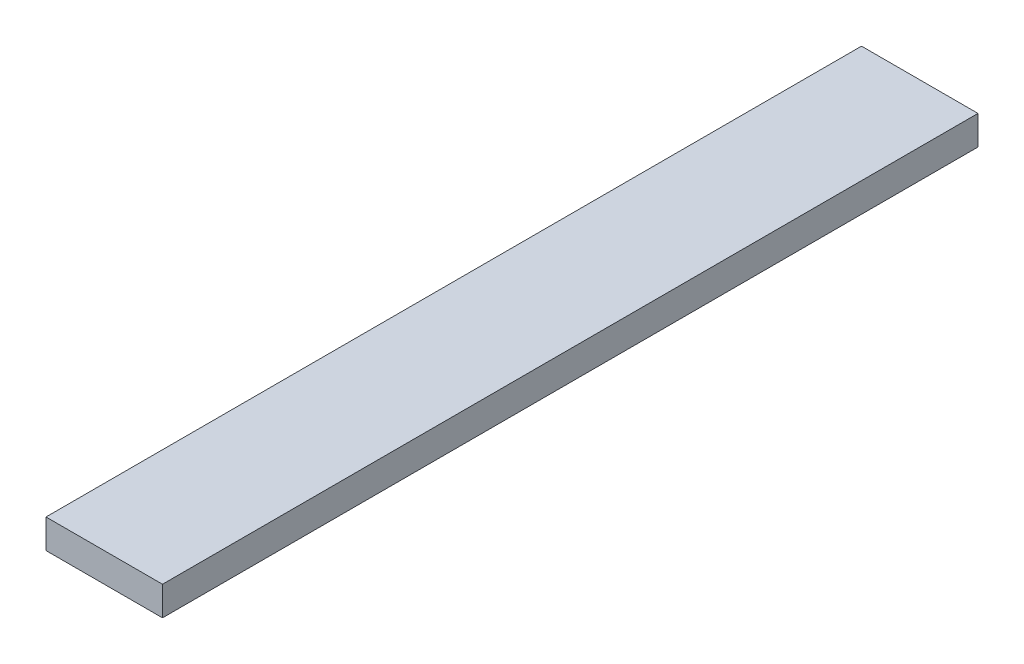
ISO-10303-21;
HEADER;
FILE_DESCRIPTION(('STEP AP214'),'2;1');
FILE_NAME('part.step','',(''),(''),'','','');
FILE_SCHEMA(('AUTOMOTIVE_DESIGN { 1 0 10303 214 1 1 1 1 }'));
ENDSEC;
DATA;
#1=APPLICATION_CONTEXT('core data for automotive mechanical design processes');
#2=APPLICATION_PROTOCOL_DEFINITION('international standard','automotive_design',2000,#1);
#3=PRODUCT_CONTEXT('',#1,'mechanical');
#4=PRODUCT('Part','Part','',(#3));
#5=PRODUCT_RELATED_PRODUCT_CATEGORY('part','',(#4));
#6=PRODUCT_DEFINITION_FORMATION('','',#4);
#7=PRODUCT_DEFINITION_CONTEXT('part definition',#1,'design');
#8=PRODUCT_DEFINITION('design','',#6,#7);
#9=PRODUCT_DEFINITION_SHAPE('','',#8);
#10=(LENGTH_UNIT() NAMED_UNIT(*) SI_UNIT(.MILLI.,.METRE.));
#11=(NAMED_UNIT(*) PLANE_ANGLE_UNIT() SI_UNIT($,.RADIAN.));
#12=(NAMED_UNIT(*) SI_UNIT($,.STERADIAN.) SOLID_ANGLE_UNIT());
#13=UNCERTAINTY_MEASURE_WITH_UNIT(LENGTH_MEASURE(1.E-05),#10,'distance_accuracy_value','');
#14=(GEOMETRIC_REPRESENTATION_CONTEXT(3) GLOBAL_UNCERTAINTY_ASSIGNED_CONTEXT((#13)) GLOBAL_UNIT_ASSIGNED_CONTEXT((#10,
#11,#12)) REPRESENTATION_CONTEXT('',''));
#15=CARTESIAN_POINT('',(0.,0.,0.));
#16=DIRECTION('',(0.,0.,1.));
#17=DIRECTION('',(1.,0.,0.));
#18=AXIS2_PLACEMENT_3D('',#15,#16,#17);
#19=CARTESIAN_POINT('',(-1.77635683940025E-12,1.66533453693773E-13,140.));
#20=DIRECTION('',(1.,0.,0.));
#21=DIRECTION('',(0.,0.,-1.));
#22=AXIS2_PLACEMENT_3D('',#19,#20,#21);
#23=PLANE('',#22);
#24=DIRECTION('',(0.,-1.,0.));
#25=VECTOR('',#24,1.);
#26=CARTESIAN_POINT('',(0.,0.,0.));
#27=LINE('',#26,#25);
#28=CARTESIAN_POINT('',(-8.88178419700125E-13,4.99999999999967,3.88578058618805E-13));
#29=VERTEX_POINT('',#28);
#30=CARTESIAN_POINT('',(0.,0.,0.));
#31=VERTEX_POINT('',#30);
#32=EDGE_CURVE('E81',#29,#31,#27,.T.);
#33=ORIENTED_EDGE('',*,*,#32,.T.);
#34=DIRECTION('',(0.,0.,-1.));
#35=VECTOR('',#34,1.);
#36=CARTESIAN_POINT('',(-1.77635683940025E-12,1.66533453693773E-13,140.));
#37=LINE('',#36,#35);
#38=CARTESIAN_POINT('',(-1.77635683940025E-12,1.66533453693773E-13,140.));
#39=VERTEX_POINT('',#38);
#40=EDGE_CURVE('E11',#39,#31,#37,.T.);
#41=ORIENTED_EDGE('',*,*,#40,.F.);
#42=DIRECTION('',(0.,-1.,0.));
#43=VECTOR('',#42,1.);
#44=CARTESIAN_POINT('',(-1.77635683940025E-12,1.66533453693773E-13,140.));
#45=LINE('',#44,#43);
#46=CARTESIAN_POINT('',(-1.33226762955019E-12,5.00000000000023,140.));
#47=VERTEX_POINT('',#46);
#48=EDGE_CURVE('E104',#47,#39,#45,.T.);
#49=ORIENTED_EDGE('',*,*,#48,.F.);
#50=DIRECTION('',(0.,0.,-1.));
#51=VECTOR('',#50,1.);
#52=CARTESIAN_POINT('',(-1.33226762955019E-12,5.00000000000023,140.));
#53=LINE('',#52,#51);
#54=EDGE_CURVE('E94',#47,#29,#53,.T.);
#55=ORIENTED_EDGE('',*,*,#54,.T.);
#56=EDGE_LOOP('',(#33,#41,#49,#55));
#57=FACE_BOUND('',#56,.T.);
#58=ADVANCED_FACE('F36',(#57),#23,.F.);
#59=CARTESIAN_POINT('',(-1.77635683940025E-12,1.66533453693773E-13,140.));
#60=DIRECTION('',(0.,1.,0.));
#61=DIRECTION('',(0.,0.,1.));
#62=AXIS2_PLACEMENT_3D('',#59,#60,#61);
#63=PLANE('',#62);
#64=DIRECTION('',(1.,0.,0.));
#65=VECTOR('',#64,1.);
#66=CARTESIAN_POINT('',(0.,0.,0.));
#67=LINE('',#66,#65);
#68=CARTESIAN_POINT('',(19.9999999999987,6.10622663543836E-13,-1.30451205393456E-12));
#69=VERTEX_POINT('',#68);
#70=EDGE_CURVE('E77',#31,#69,#67,.T.);
#71=ORIENTED_EDGE('',*,*,#70,.T.);
#72=DIRECTION('',(0.,0.,-1.));
#73=VECTOR('',#72,1.);
#74=CARTESIAN_POINT('',(20.,0.,139.999999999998));
#75=LINE('',#74,#73);
#76=CARTESIAN_POINT('',(20.,0.,139.999999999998));
#77=VERTEX_POINT('',#76);
#78=EDGE_CURVE('E44',#77,#69,#75,.T.);
#79=ORIENTED_EDGE('',*,*,#78,.F.);
#80=DIRECTION('',(1.,0.,0.));
#81=VECTOR('',#80,1.);
#82=CARTESIAN_POINT('',(-1.77635683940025E-12,1.66533453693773E-13,140.));
#83=LINE('',#82,#81);
#84=EDGE_CURVE('E90',#39,#77,#83,.T.);
#85=ORIENTED_EDGE('',*,*,#84,.F.);
#86=ORIENTED_EDGE('',*,*,#40,.T.);
#87=EDGE_LOOP('',(#71,#79,#85,#86));
#88=FACE_BOUND('',#87,.T.);
#89=ADVANCED_FACE('F89',(#88),#63,.F.);
#90=CARTESIAN_POINT('',(20.,0.,139.999999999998));
#91=DIRECTION('',(-1.,0.,0.));
#92=DIRECTION('',(0.,0.,1.));
#93=AXIS2_PLACEMENT_3D('',#90,#91,#92);
#94=PLANE('',#93);
#95=DIRECTION('',(0.,1.,0.));
#96=VECTOR('',#95,1.);
#97=CARTESIAN_POINT('',(19.9999999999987,6.10622663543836E-13,-1.30451205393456E-12));
#98=LINE('',#97,#96);
#99=CARTESIAN_POINT('',(19.9999999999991,5.00000000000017,-1.49880108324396E-12));
#100=VERTEX_POINT('',#99);
#101=EDGE_CURVE('E82',#69,#100,#98,.T.);
#102=ORIENTED_EDGE('',*,*,#101,.T.);
#103=DIRECTION('',(0.,0.,-1.));
#104=VECTOR('',#103,1.);
#105=CARTESIAN_POINT('',(19.9999999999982,4.99999999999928,139.999999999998));
#106=LINE('',#105,#104);
#107=CARTESIAN_POINT('',(19.9999999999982,4.99999999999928,139.999999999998));
#108=VERTEX_POINT('',#107);
#109=EDGE_CURVE('E114',#108,#100,#106,.T.);
#110=ORIENTED_EDGE('',*,*,#109,.F.);
#111=DIRECTION('',(0.,1.,0.));
#112=VECTOR('',#111,1.);
#113=CARTESIAN_POINT('',(20.,0.,139.999999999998));
#114=LINE('',#113,#112);
#115=EDGE_CURVE('E56',#77,#108,#114,.T.);
#116=ORIENTED_EDGE('',*,*,#115,.F.);
#117=ORIENTED_EDGE('',*,*,#78,.T.);
#118=EDGE_LOOP('',(#102,#110,#116,#117));
#119=FACE_BOUND('',#118,.T.);
#120=ADVANCED_FACE('F119',(#119),#94,.F.);
#121=CARTESIAN_POINT('',(-1.33226762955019E-12,5.00000000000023,140.));
#122=DIRECTION('',(0.,-1.,0.));
#123=DIRECTION('',(0.,0.,-1.));
#124=AXIS2_PLACEMENT_3D('',#121,#122,#123);
#125=PLANE('',#124);
#126=DIRECTION('',(-1.,0.,0.));
#127=VECTOR('',#126,1.);
#128=CARTESIAN_POINT('',(-8.88178419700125E-13,4.99999999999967,3.88578058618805E-13));
#129=LINE('',#128,#127);
#130=EDGE_CURVE('E101',#100,#29,#129,.T.);
#131=ORIENTED_EDGE('',*,*,#130,.T.);
#132=ORIENTED_EDGE('',*,*,#54,.F.);
#133=DIRECTION('',(-1.,0.,0.));
#134=VECTOR('',#133,1.);
#135=CARTESIAN_POINT('',(-1.33226762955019E-12,5.00000000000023,140.));
#136=LINE('',#135,#134);
#137=EDGE_CURVE('E51',#108,#47,#136,.T.);
#138=ORIENTED_EDGE('',*,*,#137,.F.);
#139=ORIENTED_EDGE('',*,*,#109,.T.);
#140=EDGE_LOOP('',(#131,#132,#138,#139));
#141=FACE_BOUND('',#140,.T.);
#142=ADVANCED_FACE('F121',(#141),#125,.F.);
#143=CARTESIAN_POINT('',(-1.33226762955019E-12,5.00000000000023,140.));
#144=DIRECTION('',(0.,0.,-1.));
#145=DIRECTION('',(-1.,0.,0.));
#146=AXIS2_PLACEMENT_3D('',#143,#144,#145);
#147=PLANE('',#146);
#148=ORIENTED_EDGE('',*,*,#48,.T.);
#149=ORIENTED_EDGE('',*,*,#84,.T.);
#150=ORIENTED_EDGE('',*,*,#115,.T.);
#151=ORIENTED_EDGE('',*,*,#137,.T.);
#152=EDGE_LOOP('',(#148,#149,#150,#151));
#153=FACE_BOUND('',#152,.T.);
#154=ADVANCED_FACE('F122',(#153),#147,.F.);
#155=CARTESIAN_POINT('',(-8.88178419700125E-13,4.99999999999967,3.88578058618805E-13));
#156=DIRECTION('',(0.,0.,-1.));
#157=DIRECTION('',(-1.,0.,0.));
#158=AXIS2_PLACEMENT_3D('',#155,#156,#157);
#159=PLANE('',#158);
#160=ORIENTED_EDGE('',*,*,#32,.F.);
#161=ORIENTED_EDGE('',*,*,#130,.F.);
#162=ORIENTED_EDGE('',*,*,#101,.F.);
#163=ORIENTED_EDGE('',*,*,#70,.F.);
#164=EDGE_LOOP('',(#160,#161,#162,#163));
#165=FACE_BOUND('',#164,.T.);
#166=ADVANCED_FACE('F78',(#165),#159,.T.);
#167=CLOSED_SHELL('',(#58,#89,#120,#142,#154,#166));
#168=MANIFOLD_SOLID_BREP('B2',#167);
#169=ADVANCED_BREP_SHAPE_REPRESENTATION('',(#18,#168),#14);
#170=SHAPE_DEFINITION_REPRESENTATION(#9,#169);
ENDSEC;
END-ISO-10303-21;
